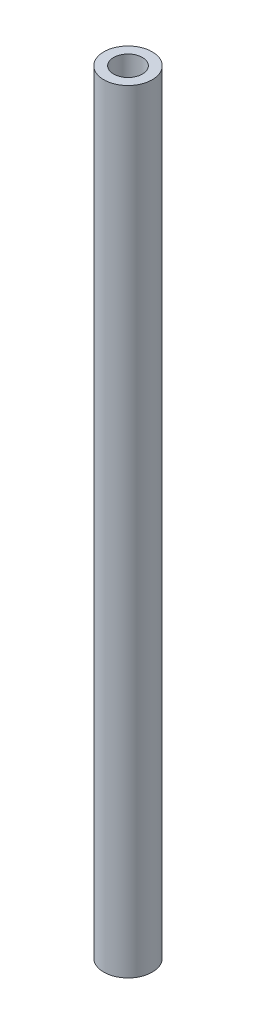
from build123d import *

# Parameters (mm, degrees)
SKETCH1_R                       = 2.3876
EXTRUDE1_DEPTH                  = 76.2
F_4_40_TAPPED_HOLE1_D           = 2.2606
F_4_40_TAPPED_HOLE1_DEPTH       = 12.954
F_4_40_TAPPED_HOLE1_CBORE_D     = 2.8448
F_4_40_TAPPED_HOLE1_CBORE_DEPTH = 9.652
F_4_40_TAPPED_HOLE1_TIP         = 0.679152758


with BuildPart() as part:
    # Sketch1 → Extrude1 (new body)
    with BuildSketch(Plane(origin=(0, 0, 0), x_dir=(1, 0, 0), z_dir=(0, 1, 0))):
        with Locations(Location((0, 0, 0), (0, 0, 90))):
            Circle(SKETCH1_R)
    extrude(amount=EXTRUDE1_DEPTH)

    # 4-40 Tapped Hole1
    with Locations(Plane.ZX.offset(76.2)):
        with Locations((0, 0)):
            CounterBoreHole(F_4_40_TAPPED_HOLE1_D / 2, F_4_40_TAPPED_HOLE1_CBORE_D / 2, F_4_40_TAPPED_HOLE1_CBORE_DEPTH, depth=F_4_40_TAPPED_HOLE1_DEPTH)
            with Locations((0, 0, -(F_4_40_TAPPED_HOLE1_DEPTH + F_4_40_TAPPED_HOLE1_TIP / 2))):  # 118° drill point
                Cone(0, F_4_40_TAPPED_HOLE1_D / 2, F_4_40_TAPPED_HOLE1_TIP, mode=Mode.SUBTRACT)


solid = part.part
